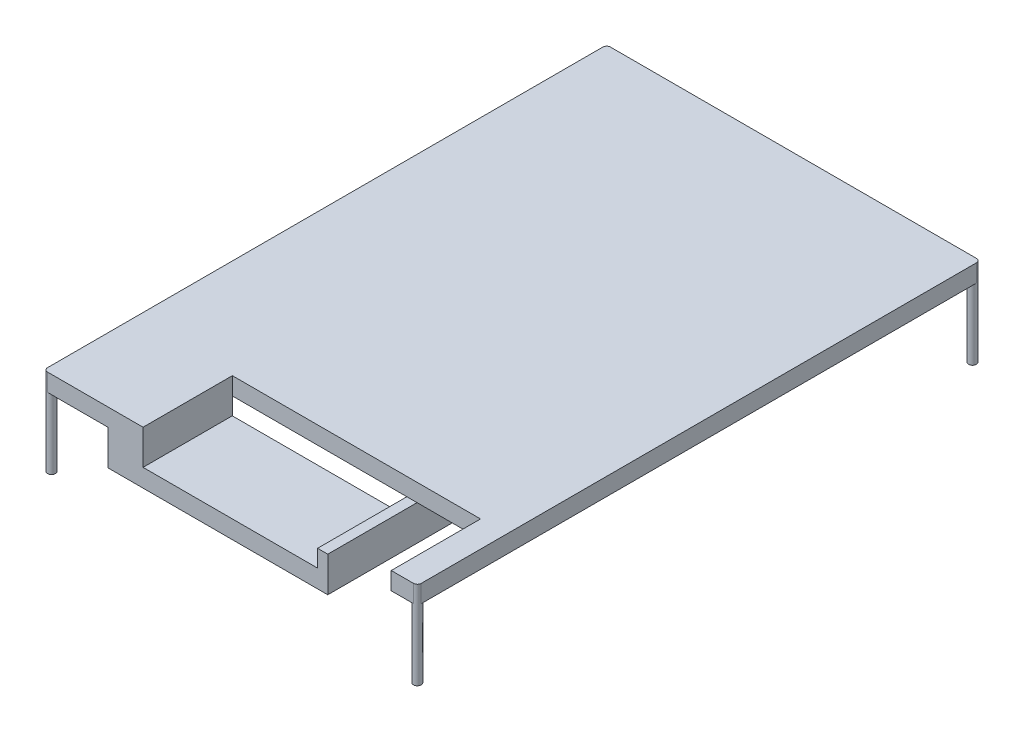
ISO-10303-21;
HEADER;
FILE_DESCRIPTION(('STEP AP214'),'2;1');
FILE_NAME('part.step','',(''),(''),'','','');
FILE_SCHEMA(('AUTOMOTIVE_DESIGN { 1 0 10303 214 1 1 1 1 }'));
ENDSEC;
DATA;
#1=APPLICATION_CONTEXT('core data for automotive mechanical design processes');
#2=APPLICATION_PROTOCOL_DEFINITION('international standard','automotive_design',2000,#1);
#3=PRODUCT_CONTEXT('',#1,'mechanical');
#4=PRODUCT('Part','Part','',(#3));
#5=PRODUCT_RELATED_PRODUCT_CATEGORY('part','',(#4));
#6=PRODUCT_DEFINITION_FORMATION('','',#4);
#7=PRODUCT_DEFINITION_CONTEXT('part definition',#1,'design');
#8=PRODUCT_DEFINITION('design','',#6,#7);
#9=PRODUCT_DEFINITION_SHAPE('','',#8);
#10=(LENGTH_UNIT() NAMED_UNIT(*) SI_UNIT(.MILLI.,.METRE.));
#11=(NAMED_UNIT(*) PLANE_ANGLE_UNIT() SI_UNIT($,.RADIAN.));
#12=(NAMED_UNIT(*) SI_UNIT($,.STERADIAN.) SOLID_ANGLE_UNIT());
#13=UNCERTAINTY_MEASURE_WITH_UNIT(LENGTH_MEASURE(1.E-05),#10,'distance_accuracy_value','');
#14=(GEOMETRIC_REPRESENTATION_CONTEXT(3) GLOBAL_UNCERTAINTY_ASSIGNED_CONTEXT((#13)) GLOBAL_UNIT_ASSIGNED_CONTEXT((#10,
#11,#12)) REPRESENTATION_CONTEXT('',''));
#15=CARTESIAN_POINT('',(0.,0.,0.));
#16=DIRECTION('',(0.,0.,1.));
#17=DIRECTION('',(1.,0.,0.));
#18=AXIS2_PLACEMENT_3D('',#15,#16,#17);
#19=CARTESIAN_POINT('',(-66.04,25.4,0.));
#20=DIRECTION('',(0.,1.,0.));
#21=DIRECTION('',(0.,0.,1.));
#22=AXIS2_PLACEMENT_3D('',#19,#20,#21);
#23=PLANE('',#22);
#24=DIRECTION('',(0.,0.,-1.));
#25=VECTOR('',#24,1.);
#26=CARTESIAN_POINT('',(31.4191477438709,25.4,152.860115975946));
#27=LINE('',#26,#25);
#28=CARTESIAN_POINT('',(31.4191477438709,25.4,169.568545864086));
#29=VERTEX_POINT('',#28);
#30=CARTESIAN_POINT('',(31.4191477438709,25.4,152.860115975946));
#31=VERTEX_POINT('',#30);
#32=EDGE_CURVE('E11',#29,#31,#27,.T.);
#33=ORIENTED_EDGE('',*,*,#32,.F.);
#34=DIRECTION('',(-1.,0.,0.));
#35=VECTOR('',#34,1.);
#36=CARTESIAN_POINT('',(-66.04,25.4,169.568545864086));
#37=LINE('',#36,#35);
#38=CARTESIAN_POINT('',(-31.5808522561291,25.4,169.568545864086));
#39=VERTEX_POINT('',#38);
#40=EDGE_CURVE('E400',#29,#39,#37,.T.);
#41=ORIENTED_EDGE('',*,*,#40,.T.);
#42=DIRECTION('',(0.,0.,1.));
#43=VECTOR('',#42,1.);
#44=CARTESIAN_POINT('',(-31.5808522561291,25.4,0.));
#45=LINE('',#44,#43);
#46=CARTESIAN_POINT('',(-31.5808522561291,25.4,169.591398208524));
#47=VERTEX_POINT('',#46);
#48=EDGE_CURVE('E47',#39,#47,#45,.T.);
#49=ORIENTED_EDGE('',*,*,#48,.T.);
#50=DIRECTION('',(1.,0.,0.));
#51=VECTOR('',#50,1.);
#52=CARTESIAN_POINT('',(-31.5808522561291,25.4,169.591398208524));
#53=LINE('',#52,#51);
#54=CARTESIAN_POINT('',(-44.2808522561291,25.4,169.591398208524));
#55=VERTEX_POINT('',#54);
#56=EDGE_CURVE('E242',#55,#47,#53,.T.);
#57=ORIENTED_EDGE('',*,*,#56,.F.);
#58=DIRECTION('',(0.,0.,-1.));
#59=VECTOR('',#58,1.);
#60=CARTESIAN_POINT('',(-44.2808522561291,25.4,201.8));
#61=LINE('',#60,#59);
#62=CARTESIAN_POINT('',(-44.2808522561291,25.4,201.8));
#63=VERTEX_POINT('',#62);
#64=EDGE_CURVE('E239',#63,#55,#61,.T.);
#65=ORIENTED_EDGE('',*,*,#64,.F.);
#66=DIRECTION('',(1.,0.,0.));
#67=VECTOR('',#66,1.);
#68=CARTESIAN_POINT('',(-67.44,25.4,201.8));
#69=LINE('',#68,#67);
#70=CARTESIAN_POINT('',(-66.040000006,25.4,201.8));
#71=VERTEX_POINT('',#70);
#72=EDGE_CURVE('E334',#71,#63,#69,.T.);
#73=ORIENTED_EDGE('',*,*,#72,.F.);
#74=CARTESIAN_POINT('',(-66.040000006,25.4,200.400000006));
#75=DIRECTION('',(0.,-1.,0.));
#76=DIRECTION('',(0.,0.,-1.));
#77=AXIS2_PLACEMENT_3D('',#74,#75,#76);
#78=CIRCLE('',#77,1.39999999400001);
#79=CARTESIAN_POINT('',(-67.44,25.4,200.400000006));
#80=VERTEX_POINT('',#79);
#81=EDGE_CURVE('E309',#80,#71,#78,.T.);
#82=ORIENTED_EDGE('',*,*,#81,.F.);
#83=DIRECTION('',(0.,0.,1.));
#84=VECTOR('',#83,1.);
#85=CARTESIAN_POINT('',(-67.44,25.4,0.));
#86=LINE('',#85,#84);
#87=CARTESIAN_POINT('',(-67.44,25.4,0.));
#88=VERTEX_POINT('',#87);
#89=EDGE_CURVE('E360',#88,#80,#86,.T.);
#90=ORIENTED_EDGE('',*,*,#89,.F.);
#91=CARTESIAN_POINT('',(-66.04,25.4,0.));
#92=DIRECTION('',(0.,1.,0.));
#93=DIRECTION('',(0.,0.,1.));
#94=AXIS2_PLACEMENT_3D('',#91,#92,#93);
#95=CIRCLE('',#94,1.4);
#96=CARTESIAN_POINT('',(-66.04,25.4,-1.39999999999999));
#97=VERTEX_POINT('',#96);
#98=EDGE_CURVE('E385',#88,#97,#95,.T.);
#99=ORIENTED_EDGE('',*,*,#98,.T.);
#100=DIRECTION('',(-1.,0.,0.));
#101=VECTOR('',#100,1.);
#102=CARTESIAN_POINT('',(-66.04,25.4,-1.39999999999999));
#103=LINE('',#102,#101);
#104=CARTESIAN_POINT('',(66.04,25.4,-1.39999999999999));
#105=VERTEX_POINT('',#104);
#106=EDGE_CURVE('E352',#105,#97,#103,.T.);
#107=ORIENTED_EDGE('',*,*,#106,.F.);
#108=CARTESIAN_POINT('',(66.04,25.4,0.));
#109=DIRECTION('',(0.,1.,0.));
#110=DIRECTION('',(0.,0.,1.));
#111=AXIS2_PLACEMENT_3D('',#108,#109,#110);
#112=CIRCLE('',#111,1.4);
#113=CARTESIAN_POINT('',(67.44,25.4,0.));
#114=VERTEX_POINT('',#113);
#115=EDGE_CURVE('E310',#105,#114,#112,.T.);
#116=ORIENTED_EDGE('',*,*,#115,.T.);
#117=DIRECTION('',(0.,0.,-1.));
#118=VECTOR('',#117,1.);
#119=CARTESIAN_POINT('',(67.44,25.4,0.));
#120=LINE('',#119,#118);
#121=CARTESIAN_POINT('',(67.44,25.4,200.400000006));
#122=VERTEX_POINT('',#121);
#123=EDGE_CURVE('E324',#122,#114,#120,.T.);
#124=ORIENTED_EDGE('',*,*,#123,.F.);
#125=CARTESIAN_POINT('',(66.040000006,25.4,200.400000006));
#126=DIRECTION('',(0.,-1.,0.));
#127=DIRECTION('',(0.,0.,1.));
#128=AXIS2_PLACEMENT_3D('',#125,#126,#127);
#129=CIRCLE('',#128,1.39999999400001);
#130=CARTESIAN_POINT('',(66.040000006,25.4,201.8));
#131=VERTEX_POINT('',#130);
#132=EDGE_CURVE('E314',#131,#122,#129,.T.);
#133=ORIENTED_EDGE('',*,*,#132,.F.);
#134=CARTESIAN_POINT('',(58.0077037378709,25.4,201.8));
#135=VERTEX_POINT('',#134);
#136=EDGE_CURVE('E362',#135,#131,#69,.T.);
#137=ORIENTED_EDGE('',*,*,#136,.F.);
#138=DIRECTION('',(0.,0.,-1.));
#139=VECTOR('',#138,1.);
#140=CARTESIAN_POINT('',(58.0077037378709,25.4,0.));
#141=LINE('',#140,#139);
#142=CARTESIAN_POINT('',(58.0077037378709,25.4,169.568545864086));
#143=VERTEX_POINT('',#142);
#144=EDGE_CURVE('E394',#135,#143,#141,.T.);
#145=ORIENTED_EDGE('',*,*,#144,.T.);
#146=CARTESIAN_POINT('',(35.1004777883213,25.4,169.568545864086));
#147=VERTEX_POINT('',#146);
#148=EDGE_CURVE('E396',#143,#147,#37,.T.);
#149=ORIENTED_EDGE('',*,*,#148,.T.);
#150=DIRECTION('',(0.,0.,1.));
#151=VECTOR('',#150,1.);
#152=CARTESIAN_POINT('',(35.1004777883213,25.4,152.860115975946));
#153=LINE('',#152,#151);
#154=CARTESIAN_POINT('',(35.1004777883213,25.4,152.860115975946));
#155=VERTEX_POINT('',#154);
#156=EDGE_CURVE('E444',#155,#147,#153,.T.);
#157=ORIENTED_EDGE('',*,*,#156,.F.);
#158=DIRECTION('',(1.,0.,0.));
#159=VECTOR('',#158,1.);
#160=CARTESIAN_POINT('',(31.4191477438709,25.4,152.860115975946));
#161=LINE('',#160,#159);
#162=EDGE_CURVE('E61',#31,#155,#161,.T.);
#163=ORIENTED_EDGE('',*,*,#162,.F.);
#164=EDGE_LOOP('',(#33,#41,#49,#57,#65,#73,#82,#90,#99,#107,#116,#124,#133,#137,#145,#149,#157,#163));
#165=FACE_BOUND('',#164,.T.);
#166=ADVANCED_FACE('F44',(#165),#23,.F.);
#167=CARTESIAN_POINT('',(-31.5808522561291,0.,169.568545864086));
#168=DIRECTION('',(-1.,0.,0.));
#169=DIRECTION('',(0.,0.,1.));
#170=AXIS2_PLACEMENT_3D('',#167,#168,#169);
#171=PLANE('',#170);
#172=DIRECTION('',(0.,0.,1.));
#173=VECTOR('',#172,1.);
#174=CARTESIAN_POINT('',(-31.5808522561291,19.2,169.591398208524));
#175=LINE('',#174,#173);
#176=CARTESIAN_POINT('',(-31.5808522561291,19.2,169.591398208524));
#177=VERTEX_POINT('',#176);
#178=CARTESIAN_POINT('',(-31.5808522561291,19.2,201.8));
#179=VERTEX_POINT('',#178);
#180=EDGE_CURVE('E212',#177,#179,#175,.T.);
#181=ORIENTED_EDGE('',*,*,#180,.F.);
#182=DIRECTION('',(0.,1.,0.));
#183=VECTOR('',#182,1.);
#184=CARTESIAN_POINT('',(-31.5808522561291,12.7,169.591398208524));
#185=LINE('',#184,#183);
#186=EDGE_CURVE('E246',#177,#47,#185,.T.);
#187=ORIENTED_EDGE('',*,*,#186,.T.);
#188=ORIENTED_EDGE('',*,*,#48,.F.);
#189=DIRECTION('',(0.,1.,0.));
#190=VECTOR('',#189,1.);
#191=CARTESIAN_POINT('',(-31.5808522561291,0.,169.568545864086));
#192=LINE('',#191,#190);
#193=CARTESIAN_POINT('',(-31.5808522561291,31.75,169.568545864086));
#194=VERTEX_POINT('',#193);
#195=EDGE_CURVE('E276',#39,#194,#192,.T.);
#196=ORIENTED_EDGE('',*,*,#195,.T.);
#197=DIRECTION('',(0.,0.,1.));
#198=VECTOR('',#197,1.);
#199=CARTESIAN_POINT('',(-31.5808522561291,31.75,169.568545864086));
#200=LINE('',#199,#198);
#201=CARTESIAN_POINT('',(-31.5808522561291,31.75,201.8));
#202=VERTEX_POINT('',#201);
#203=EDGE_CURVE('E266',#194,#202,#200,.T.);
#204=ORIENTED_EDGE('',*,*,#203,.T.);
#205=DIRECTION('',(0.,1.,0.));
#206=VECTOR('',#205,1.);
#207=CARTESIAN_POINT('',(-31.5808522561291,31.75,201.8));
#208=LINE('',#207,#206);
#209=EDGE_CURVE('E290',#179,#202,#208,.T.);
#210=ORIENTED_EDGE('',*,*,#209,.F.);
#211=EDGE_LOOP('',(#181,#187,#188,#196,#204,#210));
#212=FACE_BOUND('',#211,.T.);
#213=ADVANCED_FACE('F411',(#212),#171,.F.);
#214=CARTESIAN_POINT('',(-67.44,31.75,201.8));
#215=DIRECTION('',(0.,0.,-1.));
#216=DIRECTION('',(-1.,0.,0.));
#217=AXIS2_PLACEMENT_3D('',#214,#215,#216);
#218=PLANE('',#217);
#219=ORIENTED_EDGE('',*,*,#72,.T.);
#220=DIRECTION('',(0.,1.,0.));
#221=VECTOR('',#220,1.);
#222=CARTESIAN_POINT('',(-44.2808522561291,12.7,201.8));
#223=LINE('',#222,#221);
#224=CARTESIAN_POINT('',(-44.2808522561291,12.7,201.8));
#225=VERTEX_POINT('',#224);
#226=EDGE_CURVE('E265',#225,#63,#223,.T.);
#227=ORIENTED_EDGE('',*,*,#226,.F.);
#228=DIRECTION('',(-1.,0.,0.));
#229=VECTOR('',#228,1.);
#230=CARTESIAN_POINT('',(-31.5808522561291,12.7,201.8));
#231=LINE('',#230,#229);
#232=CARTESIAN_POINT('',(35.1004777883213,12.7,201.8));
#233=VERTEX_POINT('',#232);
#234=EDGE_CURVE('E238',#233,#225,#231,.T.);
#235=ORIENTED_EDGE('',*,*,#234,.F.);
#236=DIRECTION('',(0.,1.,0.));
#237=VECTOR('',#236,1.);
#238=CARTESIAN_POINT('',(35.1004777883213,12.7,201.8));
#239=LINE('',#238,#237);
#240=CARTESIAN_POINT('',(35.1004777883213,25.4,201.8));
#241=VERTEX_POINT('',#240);
#242=EDGE_CURVE('E222',#233,#241,#239,.T.);
#243=ORIENTED_EDGE('',*,*,#242,.T.);
#244=DIRECTION('',(-1.,0.,0.));
#245=VECTOR('',#244,1.);
#246=CARTESIAN_POINT('',(31.4191477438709,25.4,201.8));
#247=LINE('',#246,#245);
#248=CARTESIAN_POINT('',(31.4191477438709,25.4,201.8));
#249=VERTEX_POINT('',#248);
#250=EDGE_CURVE('E200',#241,#249,#247,.T.);
#251=ORIENTED_EDGE('',*,*,#250,.T.);
#252=DIRECTION('',(0.,1.,0.));
#253=VECTOR('',#252,1.);
#254=CARTESIAN_POINT('',(31.4191477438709,12.7,201.8));
#255=LINE('',#254,#253);
#256=CARTESIAN_POINT('',(31.4191477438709,19.2,201.8));
#257=VERTEX_POINT('',#256);
#258=EDGE_CURVE('E431',#257,#249,#255,.T.);
#259=ORIENTED_EDGE('',*,*,#258,.F.);
#260=DIRECTION('',(-1.,0.,0.));
#261=VECTOR('',#260,1.);
#262=CARTESIAN_POINT('',(31.4191477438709,19.2,201.8));
#263=LINE('',#262,#261);
#264=EDGE_CURVE('E229',#257,#179,#263,.T.);
#265=ORIENTED_EDGE('',*,*,#264,.T.);
#266=ORIENTED_EDGE('',*,*,#209,.T.);
#267=DIRECTION('',(1.,0.,0.));
#268=VECTOR('',#267,1.);
#269=CARTESIAN_POINT('',(-67.44,31.75,201.8));
#270=LINE('',#269,#268);
#271=CARTESIAN_POINT('',(-66.040000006,31.75,201.8));
#272=VERTEX_POINT('',#271);
#273=EDGE_CURVE('E350',#272,#202,#270,.T.);
#274=ORIENTED_EDGE('',*,*,#273,.F.);
#275=DIRECTION('',(0.,-1.,0.));
#276=VECTOR('',#275,1.);
#277=CARTESIAN_POINT('',(-66.040000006,50.8,201.8));
#278=LINE('',#277,#276);
#279=EDGE_CURVE('E298',#272,#71,#278,.T.);
#280=ORIENTED_EDGE('',*,*,#279,.T.);
#281=EDGE_LOOP('',(#219,#227,#235,#243,#251,#259,#265,#266,#274,#280));
#282=FACE_BOUND('',#281,.T.);
#283=ADVANCED_FACE('F427',(#282),#218,.F.);
#284=CARTESIAN_POINT('',(-67.44,31.75,0.));
#285=DIRECTION('',(1.,0.,0.));
#286=DIRECTION('',(0.,0.,-1.));
#287=AXIS2_PLACEMENT_3D('',#284,#285,#286);
#288=PLANE('',#287);
#289=DIRECTION('',(0.,-1.,0.));
#290=VECTOR('',#289,1.);
#291=CARTESIAN_POINT('',(-67.44,50.8,200.400000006));
#292=LINE('',#291,#290);
#293=CARTESIAN_POINT('',(-67.44,31.75,200.400000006));
#294=VERTEX_POINT('',#293);
#295=EDGE_CURVE('E295',#294,#80,#292,.T.);
#296=ORIENTED_EDGE('',*,*,#295,.F.);
#297=DIRECTION('',(0.,0.,1.));
#298=VECTOR('',#297,1.);
#299=CARTESIAN_POINT('',(-67.44,31.75,0.));
#300=LINE('',#299,#298);
#301=CARTESIAN_POINT('',(-67.44,31.75,0.));
#302=VERTEX_POINT('',#301);
#303=EDGE_CURVE('E344',#302,#294,#300,.T.);
#304=ORIENTED_EDGE('',*,*,#303,.F.);
#305=DIRECTION('',(0.,-1.,0.));
#306=VECTOR('',#305,1.);
#307=CARTESIAN_POINT('',(-67.44,31.75,0.));
#308=LINE('',#307,#306);
#309=EDGE_CURVE('E353',#302,#88,#308,.T.);
#310=ORIENTED_EDGE('',*,*,#309,.T.);
#311=ORIENTED_EDGE('',*,*,#89,.T.);
#312=EDGE_LOOP('',(#296,#304,#310,#311));
#313=FACE_BOUND('',#312,.T.);
#314=ADVANCED_FACE('F488',(#313),#288,.F.);
#315=CARTESIAN_POINT('',(58.0077037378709,31.75,201.8));
#316=VERTEX_POINT('',#315);
#317=CARTESIAN_POINT('',(66.040000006,31.75,201.8));
#318=VERTEX_POINT('',#317);
#319=EDGE_CURVE('E347',#316,#318,#270,.T.);
#320=ORIENTED_EDGE('',*,*,#319,.F.);
#321=DIRECTION('',(0.,-1.,0.));
#322=VECTOR('',#321,1.);
#323=CARTESIAN_POINT('',(58.0077037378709,31.75,201.8));
#324=LINE('',#323,#322);
#325=EDGE_CURVE('E285',#316,#135,#324,.T.);
#326=ORIENTED_EDGE('',*,*,#325,.T.);
#327=ORIENTED_EDGE('',*,*,#136,.T.);
#328=DIRECTION('',(0.,-1.,0.));
#329=VECTOR('',#328,1.);
#330=CARTESIAN_POINT('',(66.040000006,50.8,201.8));
#331=LINE('',#330,#329);
#332=EDGE_CURVE('E292',#318,#131,#331,.T.);
#333=ORIENTED_EDGE('',*,*,#332,.F.);
#334=EDGE_LOOP('',(#320,#326,#327,#333));
#335=FACE_BOUND('',#334,.T.);
#336=ADVANCED_FACE('F456',(#335),#218,.F.);
#337=CARTESIAN_POINT('',(-66.04,31.75,0.));
#338=DIRECTION('',(0.,1.,0.));
#339=DIRECTION('',(0.,0.,1.));
#340=AXIS2_PLACEMENT_3D('',#337,#338,#339);
#341=PLANE('',#340);
#342=ORIENTED_EDGE('',*,*,#203,.F.);
#343=DIRECTION('',(-1.,0.,0.));
#344=VECTOR('',#343,1.);
#345=CARTESIAN_POINT('',(-31.5808522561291,31.75,169.568545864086));
#346=LINE('',#345,#344);
#347=CARTESIAN_POINT('',(58.0077037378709,31.75,169.568545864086));
#348=VERTEX_POINT('',#347);
#349=EDGE_CURVE('E273',#348,#194,#346,.T.);
#350=ORIENTED_EDGE('',*,*,#349,.F.);
#351=DIRECTION('',(0.,0.,-1.));
#352=VECTOR('',#351,1.);
#353=CARTESIAN_POINT('',(58.0077037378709,31.75,169.568545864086));
#354=LINE('',#353,#352);
#355=EDGE_CURVE('E269',#316,#348,#354,.T.);
#356=ORIENTED_EDGE('',*,*,#355,.F.);
#357=ORIENTED_EDGE('',*,*,#319,.T.);
#358=CARTESIAN_POINT('',(66.0400000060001,31.75,200.400000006));
#359=DIRECTION('',(0.,1.,0.));
#360=DIRECTION('',(0.,0.,1.));
#361=AXIS2_PLACEMENT_3D('',#358,#359,#360);
#362=CIRCLE('',#361,1.39999999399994);
#363=CARTESIAN_POINT('',(67.44,31.75,200.400000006));
#364=VERTEX_POINT('',#363);
#365=EDGE_CURVE('E384',#364,#318,#362,.F.);
#366=ORIENTED_EDGE('',*,*,#365,.F.);
#367=DIRECTION('',(0.,0.,-1.));
#368=VECTOR('',#367,1.);
#369=CARTESIAN_POINT('',(67.44,31.75,0.));
#370=LINE('',#369,#368);
#371=CARTESIAN_POINT('',(67.44,31.75,0.));
#372=VERTEX_POINT('',#371);
#373=EDGE_CURVE('E328',#364,#372,#370,.T.);
#374=ORIENTED_EDGE('',*,*,#373,.T.);
#375=CARTESIAN_POINT('',(66.04,31.75,0.));
#376=DIRECTION('',(0.,1.,0.));
#377=DIRECTION('',(0.,0.,-1.));
#378=AXIS2_PLACEMENT_3D('',#375,#376,#377);
#379=CIRCLE('',#378,1.4);
#380=CARTESIAN_POINT('',(66.04,31.75,-1.39999999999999));
#381=VERTEX_POINT('',#380);
#382=EDGE_CURVE('E335',#372,#381,#379,.T.);
#383=ORIENTED_EDGE('',*,*,#382,.T.);
#384=DIRECTION('',(-1.,0.,0.));
#385=VECTOR('',#384,1.);
#386=CARTESIAN_POINT('',(-66.04,31.75,-1.39999999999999));
#387=LINE('',#386,#385);
#388=CARTESIAN_POINT('',(-66.04,31.75,-1.39999999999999));
#389=VERTEX_POINT('',#388);
#390=EDGE_CURVE('E338',#381,#389,#387,.T.);
#391=ORIENTED_EDGE('',*,*,#390,.T.);
#392=CARTESIAN_POINT('',(-66.04,31.75,0.));
#393=DIRECTION('',(0.,1.,0.));
#394=DIRECTION('',(0.,0.,1.));
#395=AXIS2_PLACEMENT_3D('',#392,#393,#394);
#396=CIRCLE('',#395,1.4);
#397=EDGE_CURVE('E337',#389,#302,#396,.T.);
#398=ORIENTED_EDGE('',*,*,#397,.T.);
#399=ORIENTED_EDGE('',*,*,#303,.T.);
#400=CARTESIAN_POINT('',(-66.040000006,31.75,200.400000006));
#401=DIRECTION('',(0.,1.,0.));
#402=DIRECTION('',(0.,0.,1.));
#403=AXIS2_PLACEMENT_3D('',#400,#401,#402);
#404=CIRCLE('',#403,1.39999999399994);
#405=EDGE_CURVE('E395',#272,#294,#404,.F.);
#406=ORIENTED_EDGE('',*,*,#405,.F.);
#407=ORIENTED_EDGE('',*,*,#273,.T.);
#408=EDGE_LOOP('',(#342,#350,#356,#357,#366,#374,#383,#391,#398,#399,#406,#407));
#409=FACE_BOUND('',#408,.T.);
#410=ADVANCED_FACE('F423',(#409),#341,.T.);
#411=CARTESIAN_POINT('',(-66.04,25.4,0.));
#412=DIRECTION('',(0.,-1.,0.));
#413=DIRECTION('',(0.,0.,-1.));
#414=AXIS2_PLACEMENT_3D('',#411,#412,#413);
#415=CYLINDRICAL_SURFACE('',#414,1.4);
#416=ORIENTED_EDGE('',*,*,#98,.F.);
#417=ORIENTED_EDGE('',*,*,#309,.F.);
#418=ORIENTED_EDGE('',*,*,#397,.F.);
#419=DIRECTION('',(0.,-1.,0.));
#420=VECTOR('',#419,1.);
#421=CARTESIAN_POINT('',(-66.04,31.75,-1.39999999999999));
#422=LINE('',#421,#420);
#423=EDGE_CURVE('E369',#389,#97,#422,.T.);
#424=ORIENTED_EDGE('',*,*,#423,.T.);
#425=EDGE_LOOP('',(#416,#417,#418,#424));
#426=FACE_BOUND('',#425,.T.);
#427=CARTESIAN_POINT('',(-66.04,0.,0.));
#428=DIRECTION('',(0.,1.,0.));
#429=DIRECTION('',(0.,0.,1.));
#430=AXIS2_PLACEMENT_3D('',#427,#428,#429);
#431=CIRCLE('',#430,1.4);
#432=CARTESIAN_POINT('',(-66.04,0.,1.40000000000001));
#433=VERTEX_POINT('',#432);
#434=EDGE_CURVE('E381',#433,#433,#431,.T.);
#435=ORIENTED_EDGE('',*,*,#434,.T.);
#436=EDGE_LOOP('',(#435));
#437=FACE_BOUND('',#436,.T.);
#438=ADVANCED_FACE('F50',(#426,#437),#415,.T.);
#439=CARTESIAN_POINT('',(-66.04,0.,0.));
#440=DIRECTION('',(0.,1.,0.));
#441=DIRECTION('',(0.,0.,1.));
#442=AXIS2_PLACEMENT_3D('',#439,#440,#441);
#443=PLANE('',#442);
#444=ORIENTED_EDGE('',*,*,#434,.F.);
#445=EDGE_LOOP('',(#444));
#446=FACE_BOUND('',#445,.T.);
#447=ADVANCED_FACE('F529',(#446),#443,.F.);
#448=CARTESIAN_POINT('',(67.44,31.75,0.));
#449=DIRECTION('',(-1.,0.,0.));
#450=DIRECTION('',(0.,0.,1.));
#451=AXIS2_PLACEMENT_3D('',#448,#449,#450);
#452=PLANE('',#451);
#453=ORIENTED_EDGE('',*,*,#373,.F.);
#454=DIRECTION('',(0.,-1.,0.));
#455=VECTOR('',#454,1.);
#456=CARTESIAN_POINT('',(67.44,50.8,200.400000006));
#457=LINE('',#456,#455);
#458=EDGE_CURVE('E297',#364,#122,#457,.T.);
#459=ORIENTED_EDGE('',*,*,#458,.T.);
#460=ORIENTED_EDGE('',*,*,#123,.T.);
#461=DIRECTION('',(0.,-1.,0.));
#462=VECTOR('',#461,1.);
#463=CARTESIAN_POINT('',(67.44,31.75,0.));
#464=LINE('',#463,#462);
#465=EDGE_CURVE('E380',#372,#114,#464,.T.);
#466=ORIENTED_EDGE('',*,*,#465,.F.);
#467=EDGE_LOOP('',(#453,#459,#460,#466));
#468=FACE_BOUND('',#467,.T.);
#469=ADVANCED_FACE('F470',(#468),#452,.F.);
#470=CARTESIAN_POINT('',(66.04,31.75,0.));
#471=DIRECTION('',(0.,-1.,0.));
#472=DIRECTION('',(0.,0.,-1.));
#473=AXIS2_PLACEMENT_3D('',#470,#471,#472);
#474=CYLINDRICAL_SURFACE('',#473,1.4);
#475=ORIENTED_EDGE('',*,*,#465,.T.);
#476=ORIENTED_EDGE('',*,*,#115,.F.);
#477=DIRECTION('',(0.,-1.,0.));
#478=VECTOR('',#477,1.);
#479=CARTESIAN_POINT('',(66.04,31.75,-1.39999999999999));
#480=LINE('',#479,#478);
#481=EDGE_CURVE('E373',#381,#105,#480,.T.);
#482=ORIENTED_EDGE('',*,*,#481,.F.);
#483=ORIENTED_EDGE('',*,*,#382,.F.);
#484=EDGE_LOOP('',(#475,#476,#482,#483));
#485=FACE_BOUND('',#484,.T.);
#486=CARTESIAN_POINT('',(66.04,0.,0.));
#487=DIRECTION('',(0.,1.,0.));
#488=DIRECTION('',(0.,0.,1.));
#489=AXIS2_PLACEMENT_3D('',#486,#487,#488);
#490=CIRCLE('',#489,1.4);
#491=CARTESIAN_POINT('',(66.04,0.,1.40000000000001));
#492=VERTEX_POINT('',#491);
#493=EDGE_CURVE('E321',#492,#492,#490,.T.);
#494=ORIENTED_EDGE('',*,*,#493,.T.);
#495=EDGE_LOOP('',(#494));
#496=FACE_BOUND('',#495,.T.);
#497=ADVANCED_FACE('F475',(#485,#496),#474,.T.);
#498=CARTESIAN_POINT('',(-66.04,31.75,-1.39999999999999));
#499=DIRECTION('',(0.,0.,1.));
#500=DIRECTION('',(1.,0.,0.));
#501=AXIS2_PLACEMENT_3D('',#498,#499,#500);
#502=PLANE('',#501);
#503=ORIENTED_EDGE('',*,*,#106,.T.);
#504=ORIENTED_EDGE('',*,*,#423,.F.);
#505=ORIENTED_EDGE('',*,*,#390,.F.);
#506=ORIENTED_EDGE('',*,*,#481,.T.);
#507=EDGE_LOOP('',(#503,#504,#505,#506));
#508=FACE_BOUND('',#507,.T.);
#509=ADVANCED_FACE('F481',(#508),#502,.F.);
#510=CARTESIAN_POINT('',(66.04,0.,0.));
#511=DIRECTION('',(0.,1.,0.));
#512=DIRECTION('',(0.,0.,1.));
#513=AXIS2_PLACEMENT_3D('',#510,#511,#512);
#514=PLANE('',#513);
#515=ORIENTED_EDGE('',*,*,#493,.F.);
#516=EDGE_LOOP('',(#515));
#517=FACE_BOUND('',#516,.T.);
#518=ADVANCED_FACE('F528',(#517),#514,.F.);
#519=CARTESIAN_POINT('',(66.040000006,0.,200.400000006));
#520=DIRECTION('',(0.,1.,0.));
#521=DIRECTION('',(0.,0.,1.));
#522=AXIS2_PLACEMENT_3D('',#519,#520,#521);
#523=CYLINDRICAL_SURFACE('',#522,1.39999999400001);
#524=CARTESIAN_POINT('',(66.040000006,0.,200.400000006));
#525=DIRECTION('',(0.,-1.,0.));
#526=DIRECTION('',(0.,0.,1.));
#527=AXIS2_PLACEMENT_3D('',#524,#525,#526);
#528=CIRCLE('',#527,1.39999999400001);
#529=CARTESIAN_POINT('',(66.040000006,0.,201.8));
#530=VERTEX_POINT('',#529);
#531=EDGE_CURVE('E293',#530,#530,#528,.T.);
#532=ORIENTED_EDGE('',*,*,#531,.F.);
#533=EDGE_LOOP('',(#532));
#534=FACE_BOUND('',#533,.T.);
#535=ORIENTED_EDGE('',*,*,#132,.T.);
#536=ORIENTED_EDGE('',*,*,#458,.F.);
#537=ORIENTED_EDGE('',*,*,#365,.T.);
#538=ORIENTED_EDGE('',*,*,#332,.T.);
#539=EDGE_LOOP('',(#535,#536,#537,#538));
#540=FACE_BOUND('',#539,.T.);
#541=ADVANCED_FACE('F464',(#534,#540),#523,.T.);
#542=CARTESIAN_POINT('',(66.040000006,0.,200.400000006));
#543=DIRECTION('',(0.,1.,0.));
#544=DIRECTION('',(0.,0.,1.));
#545=AXIS2_PLACEMENT_3D('',#542,#543,#544);
#546=PLANE('',#545);
#547=ORIENTED_EDGE('',*,*,#531,.T.);
#548=EDGE_LOOP('',(#547));
#549=FACE_BOUND('',#548,.T.);
#550=ADVANCED_FACE('F497',(#549),#546,.F.);
#551=CARTESIAN_POINT('',(-66.040000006,0.,200.400000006));
#552=DIRECTION('',(0.,1.,0.));
#553=DIRECTION('',(0.,0.,1.));
#554=AXIS2_PLACEMENT_3D('',#551,#552,#553);
#555=CYLINDRICAL_SURFACE('',#554,1.39999999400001);
#556=CARTESIAN_POINT('',(-66.040000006,0.,200.400000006));
#557=DIRECTION('',(0.,-1.,0.));
#558=DIRECTION('',(0.,0.,-1.));
#559=AXIS2_PLACEMENT_3D('',#556,#557,#558);
#560=CIRCLE('',#559,1.39999999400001);
#561=CARTESIAN_POINT('',(-66.040000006,0.,199.000000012));
#562=VERTEX_POINT('',#561);
#563=EDGE_CURVE('E303',#562,#562,#560,.T.);
#564=ORIENTED_EDGE('',*,*,#563,.F.);
#565=EDGE_LOOP('',(#564));
#566=FACE_BOUND('',#565,.T.);
#567=ORIENTED_EDGE('',*,*,#81,.T.);
#568=ORIENTED_EDGE('',*,*,#279,.F.);
#569=ORIENTED_EDGE('',*,*,#405,.T.);
#570=ORIENTED_EDGE('',*,*,#295,.T.);
#571=EDGE_LOOP('',(#567,#568,#569,#570));
#572=FACE_BOUND('',#571,.T.);
#573=ADVANCED_FACE('F492',(#566,#572),#555,.T.);
#574=CARTESIAN_POINT('',(-66.040000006,0.,200.400000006));
#575=DIRECTION('',(0.,-1.,0.));
#576=DIRECTION('',(0.,0.,-1.));
#577=AXIS2_PLACEMENT_3D('',#574,#575,#576);
#578=PLANE('',#577);
#579=ORIENTED_EDGE('',*,*,#563,.T.);
#580=EDGE_LOOP('',(#579));
#581=FACE_BOUND('',#580,.T.);
#582=ADVANCED_FACE('F494',(#581),#578,.T.);
#583=CARTESIAN_POINT('',(-31.5808522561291,0.,169.568545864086));
#584=DIRECTION('',(0.,0.,-1.));
#585=DIRECTION('',(-1.,0.,0.));
#586=AXIS2_PLACEMENT_3D('',#583,#584,#585);
#587=PLANE('',#586);
#588=DIRECTION('',(0.,1.,0.));
#589=VECTOR('',#588,1.);
#590=CARTESIAN_POINT('',(58.0077037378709,0.,169.568545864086));
#591=LINE('',#590,#589);
#592=EDGE_CURVE('E279',#143,#348,#591,.T.);
#593=ORIENTED_EDGE('',*,*,#592,.T.);
#594=ORIENTED_EDGE('',*,*,#349,.T.);
#595=ORIENTED_EDGE('',*,*,#195,.F.);
#596=ORIENTED_EDGE('',*,*,#40,.F.);
#597=EDGE_CURVE('E405',#147,#29,#37,.T.);
#598=ORIENTED_EDGE('',*,*,#597,.F.);
#599=ORIENTED_EDGE('',*,*,#148,.F.);
#600=EDGE_LOOP('',(#593,#594,#595,#596,#598,#599));
#601=FACE_BOUND('',#600,.T.);
#602=ADVANCED_FACE('F418',(#601),#587,.F.);
#603=CARTESIAN_POINT('',(58.0077037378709,0.,169.568545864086));
#604=DIRECTION('',(1.,0.,0.));
#605=DIRECTION('',(0.,0.,-1.));
#606=AXIS2_PLACEMENT_3D('',#603,#604,#605);
#607=PLANE('',#606);
#608=ORIENTED_EDGE('',*,*,#355,.T.);
#609=ORIENTED_EDGE('',*,*,#592,.F.);
#610=ORIENTED_EDGE('',*,*,#144,.F.);
#611=ORIENTED_EDGE('',*,*,#325,.F.);
#612=EDGE_LOOP('',(#608,#609,#610,#611));
#613=FACE_BOUND('',#612,.T.);
#614=ADVANCED_FACE('F453',(#613),#607,.F.);
#615=CARTESIAN_POINT('',(-44.2808522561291,12.7,201.8));
#616=DIRECTION('',(1.,0.,0.));
#617=DIRECTION('',(0.,0.,-1.));
#618=AXIS2_PLACEMENT_3D('',#615,#616,#617);
#619=PLANE('',#618);
#620=ORIENTED_EDGE('',*,*,#64,.T.);
#621=DIRECTION('',(0.,1.,0.));
#622=VECTOR('',#621,1.);
#623=CARTESIAN_POINT('',(-44.2808522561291,12.7,169.591398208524));
#624=LINE('',#623,#622);
#625=CARTESIAN_POINT('',(-44.2808522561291,12.7,169.591398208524));
#626=VERTEX_POINT('',#625);
#627=EDGE_CURVE('E256',#626,#55,#624,.T.);
#628=ORIENTED_EDGE('',*,*,#627,.F.);
#629=DIRECTION('',(0.,0.,-1.));
#630=VECTOR('',#629,1.);
#631=CARTESIAN_POINT('',(-44.2808522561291,12.7,201.8));
#632=LINE('',#631,#630);
#633=EDGE_CURVE('E241',#225,#626,#632,.T.);
#634=ORIENTED_EDGE('',*,*,#633,.F.);
#635=ORIENTED_EDGE('',*,*,#226,.T.);
#636=EDGE_LOOP('',(#620,#628,#634,#635));
#637=FACE_BOUND('',#636,.T.);
#638=ADVANCED_FACE('F554',(#637),#619,.F.);
#639=CARTESIAN_POINT('',(-31.5808522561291,12.7,169.591398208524));
#640=DIRECTION('',(0.,0.,1.));
#641=DIRECTION('',(1.,0.,0.));
#642=AXIS2_PLACEMENT_3D('',#639,#640,#641);
#643=PLANE('',#642);
#644=ORIENTED_EDGE('',*,*,#56,.T.);
#645=ORIENTED_EDGE('',*,*,#186,.F.);
#646=DIRECTION('',(-1.,0.,0.));
#647=VECTOR('',#646,1.);
#648=CARTESIAN_POINT('',(31.4191477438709,19.2,169.591398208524));
#649=LINE('',#648,#647);
#650=CARTESIAN_POINT('',(31.4191477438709,19.2,169.591398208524));
#651=VERTEX_POINT('',#650);
#652=EDGE_CURVE('E233',#651,#177,#649,.T.);
#653=ORIENTED_EDGE('',*,*,#652,.F.);
#654=DIRECTION('',(0.,1.,0.));
#655=VECTOR('',#654,1.);
#656=CARTESIAN_POINT('',(31.4191477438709,12.7,169.591398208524));
#657=LINE('',#656,#655);
#658=CARTESIAN_POINT('',(31.4191477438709,12.7,169.591398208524));
#659=VERTEX_POINT('',#658);
#660=EDGE_CURVE('E218',#659,#651,#657,.T.);
#661=ORIENTED_EDGE('',*,*,#660,.F.);
#662=DIRECTION('',(1.,0.,0.));
#663=VECTOR('',#662,1.);
#664=CARTESIAN_POINT('',(-31.5808522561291,12.7,169.591398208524));
#665=LINE('',#664,#663);
#666=EDGE_CURVE('E195',#626,#659,#665,.T.);
#667=ORIENTED_EDGE('',*,*,#666,.F.);
#668=ORIENTED_EDGE('',*,*,#627,.T.);
#669=EDGE_LOOP('',(#644,#645,#653,#661,#667,#668));
#670=FACE_BOUND('',#669,.T.);
#671=ADVANCED_FACE('F564',(#670),#643,.F.);
#672=CARTESIAN_POINT('',(0.,12.7,0.));
#673=DIRECTION('',(0.,1.,0.));
#674=DIRECTION('',(0.,0.,1.));
#675=AXIS2_PLACEMENT_3D('',#672,#673,#674);
#676=PLANE('',#675);
#677=ORIENTED_EDGE('',*,*,#666,.T.);
#678=DIRECTION('',(0.,0.,-1.));
#679=VECTOR('',#678,1.);
#680=CARTESIAN_POINT('',(31.4191477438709,12.7,152.860115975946));
#681=LINE('',#680,#679);
#682=CARTESIAN_POINT('',(31.4191477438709,12.7,152.860115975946));
#683=VERTEX_POINT('',#682);
#684=EDGE_CURVE('E188',#659,#683,#681,.T.);
#685=ORIENTED_EDGE('',*,*,#684,.T.);
#686=DIRECTION('',(1.,0.,0.));
#687=VECTOR('',#686,1.);
#688=CARTESIAN_POINT('',(31.4191477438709,12.7,152.860115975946));
#689=LINE('',#688,#687);
#690=CARTESIAN_POINT('',(35.1004777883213,12.7,152.860115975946));
#691=VERTEX_POINT('',#690);
#692=EDGE_CURVE('E189',#683,#691,#689,.T.);
#693=ORIENTED_EDGE('',*,*,#692,.T.);
#694=DIRECTION('',(0.,0.,1.));
#695=VECTOR('',#694,1.);
#696=CARTESIAN_POINT('',(35.1004777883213,12.7,152.860115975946));
#697=LINE('',#696,#695);
#698=EDGE_CURVE('E207',#691,#233,#697,.T.);
#699=ORIENTED_EDGE('',*,*,#698,.T.);
#700=ORIENTED_EDGE('',*,*,#234,.T.);
#701=ORIENTED_EDGE('',*,*,#633,.T.);
#702=EDGE_LOOP('',(#677,#685,#693,#699,#700,#701));
#703=FACE_BOUND('',#702,.T.);
#704=ADVANCED_FACE('F186',(#703),#676,.F.);
#705=CARTESIAN_POINT('',(31.4191477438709,19.2,169.591398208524));
#706=DIRECTION('',(0.,-1.,0.));
#707=DIRECTION('',(0.,0.,-1.));
#708=AXIS2_PLACEMENT_3D('',#705,#706,#707);
#709=PLANE('',#708);
#710=ORIENTED_EDGE('',*,*,#180,.T.);
#711=ORIENTED_EDGE('',*,*,#264,.F.);
#712=DIRECTION('',(0.,0.,1.));
#713=VECTOR('',#712,1.);
#714=CARTESIAN_POINT('',(31.4191477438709,19.2,169.591398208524));
#715=LINE('',#714,#713);
#716=EDGE_CURVE('E230',#651,#257,#715,.T.);
#717=ORIENTED_EDGE('',*,*,#716,.F.);
#718=ORIENTED_EDGE('',*,*,#652,.T.);
#719=EDGE_LOOP('',(#710,#711,#717,#718));
#720=FACE_BOUND('',#719,.T.);
#721=ADVANCED_FACE('F426',(#720),#709,.F.);
#722=CARTESIAN_POINT('',(31.4191477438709,12.7,152.860115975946));
#723=DIRECTION('',(1.,0.,0.));
#724=DIRECTION('',(0.,0.,-1.));
#725=AXIS2_PLACEMENT_3D('',#722,#723,#724);
#726=PLANE('',#725);
#727=ORIENTED_EDGE('',*,*,#684,.F.);
#728=ORIENTED_EDGE('',*,*,#660,.T.);
#729=ORIENTED_EDGE('',*,*,#716,.T.);
#730=ORIENTED_EDGE('',*,*,#258,.T.);
#731=EDGE_CURVE('E57',#249,#29,#27,.T.);
#732=ORIENTED_EDGE('',*,*,#731,.T.);
#733=ORIENTED_EDGE('',*,*,#32,.T.);
#734=DIRECTION('',(0.,1.,0.));
#735=VECTOR('',#734,1.);
#736=CARTESIAN_POINT('',(31.4191477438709,12.7,152.860115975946));
#737=LINE('',#736,#735);
#738=EDGE_CURVE('E204',#683,#31,#737,.T.);
#739=ORIENTED_EDGE('',*,*,#738,.F.);
#740=EDGE_LOOP('',(#727,#728,#729,#730,#732,#733,#739));
#741=FACE_BOUND('',#740,.T.);
#742=ADVANCED_FACE('F211',(#741),#726,.F.);
#743=CARTESIAN_POINT('',(31.4191477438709,12.7,152.860115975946));
#744=DIRECTION('',(0.,0.,1.));
#745=DIRECTION('',(1.,0.,0.));
#746=AXIS2_PLACEMENT_3D('',#743,#744,#745);
#747=PLANE('',#746);
#748=ORIENTED_EDGE('',*,*,#162,.T.);
#749=DIRECTION('',(0.,1.,0.));
#750=VECTOR('',#749,1.);
#751=CARTESIAN_POINT('',(35.1004777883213,12.7,152.860115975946));
#752=LINE('',#751,#750);
#753=EDGE_CURVE('E206',#691,#155,#752,.T.);
#754=ORIENTED_EDGE('',*,*,#753,.F.);
#755=ORIENTED_EDGE('',*,*,#692,.F.);
#756=ORIENTED_EDGE('',*,*,#738,.T.);
#757=EDGE_LOOP('',(#748,#754,#755,#756));
#758=FACE_BOUND('',#757,.T.);
#759=ADVANCED_FACE('F201',(#758),#747,.F.);
#760=CARTESIAN_POINT('',(35.1004777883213,12.7,152.860115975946));
#761=DIRECTION('',(-1.,0.,0.));
#762=DIRECTION('',(0.,0.,1.));
#763=AXIS2_PLACEMENT_3D('',#760,#761,#762);
#764=PLANE('',#763);
#765=ORIENTED_EDGE('',*,*,#156,.T.);
#766=EDGE_CURVE('E450',#147,#241,#153,.T.);
#767=ORIENTED_EDGE('',*,*,#766,.T.);
#768=ORIENTED_EDGE('',*,*,#242,.F.);
#769=ORIENTED_EDGE('',*,*,#698,.F.);
#770=ORIENTED_EDGE('',*,*,#753,.T.);
#771=EDGE_LOOP('',(#765,#767,#768,#769,#770));
#772=FACE_BOUND('',#771,.T.);
#773=ADVANCED_FACE('F610',(#772),#764,.F.);
#774=CARTESIAN_POINT('',(0.,25.4,0.));
#775=DIRECTION('',(0.,1.,0.));
#776=DIRECTION('',(0.,0.,1.));
#777=AXIS2_PLACEMENT_3D('',#774,#775,#776);
#778=PLANE('',#777);
#779=ORIENTED_EDGE('',*,*,#766,.F.);
#780=ORIENTED_EDGE('',*,*,#597,.T.);
#781=ORIENTED_EDGE('',*,*,#731,.F.);
#782=ORIENTED_EDGE('',*,*,#250,.F.);
#783=EDGE_LOOP('',(#779,#780,#781,#782));
#784=FACE_BOUND('',#783,.T.);
#785=ADVANCED_FACE('F452',(#784),#778,.T.);
#786=CLOSED_SHELL('',(#166,#213,#283,#314,#336,#410,#438,#447,#469,#497,#509,#518,#541,#550,
#573,#582,#602,#614,#638,#671,#704,#721,#742,#759,#773,#785));
#787=MANIFOLD_SOLID_BREP('B2',#786);
#788=ADVANCED_BREP_SHAPE_REPRESENTATION('',(#18,#787),#14);
#789=SHAPE_DEFINITION_REPRESENTATION(#9,#788);
ENDSEC;
END-ISO-10303-21;
